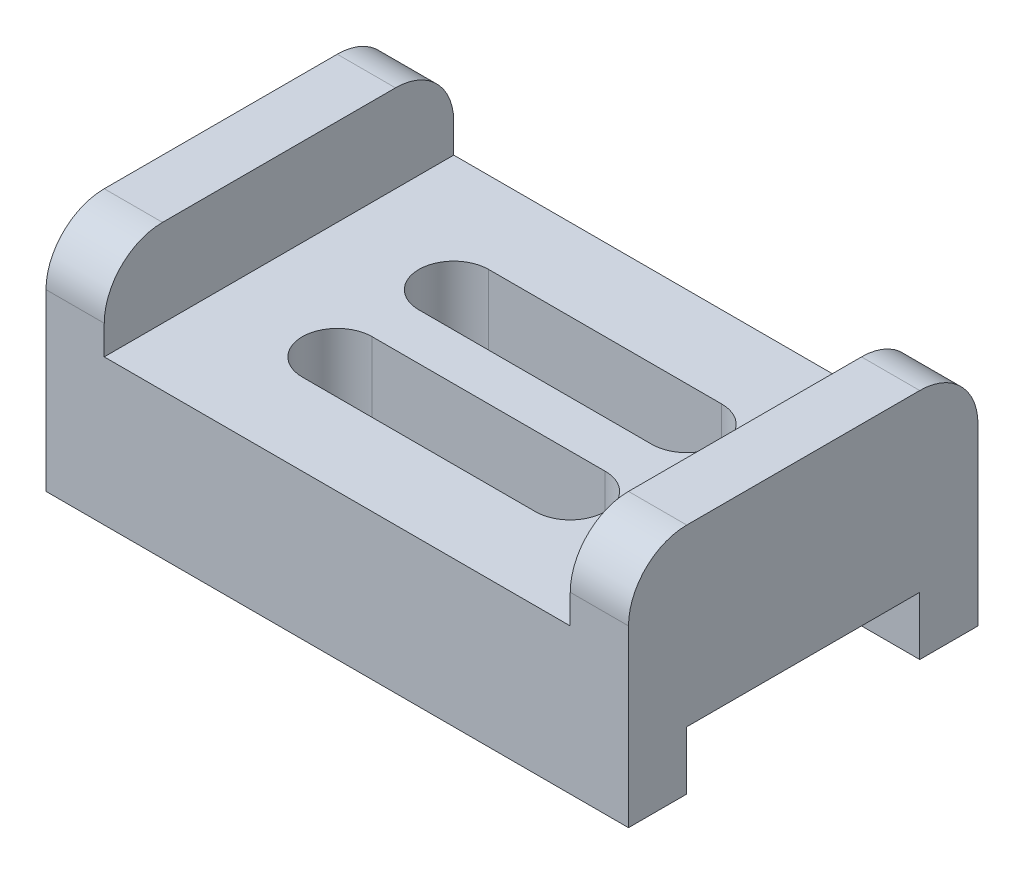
ISO-10303-21;
HEADER;
FILE_DESCRIPTION(('STEP AP214'),'2;1');
FILE_NAME('part.step','',(''),(''),'','','');
FILE_SCHEMA(('AUTOMOTIVE_DESIGN { 1 0 10303 214 1 1 1 1 }'));
ENDSEC;
DATA;
#1=APPLICATION_CONTEXT('core data for automotive mechanical design processes');
#2=APPLICATION_PROTOCOL_DEFINITION('international standard','automotive_design',2000,#1);
#3=PRODUCT_CONTEXT('',#1,'mechanical');
#4=PRODUCT('Part','Part','',(#3));
#5=PRODUCT_RELATED_PRODUCT_CATEGORY('part','',(#4));
#6=PRODUCT_DEFINITION_FORMATION('','',#4);
#7=PRODUCT_DEFINITION_CONTEXT('part definition',#1,'design');
#8=PRODUCT_DEFINITION('design','',#6,#7);
#9=PRODUCT_DEFINITION_SHAPE('','',#8);
#10=(LENGTH_UNIT() NAMED_UNIT(*) SI_UNIT(.MILLI.,.METRE.));
#11=(NAMED_UNIT(*) PLANE_ANGLE_UNIT() SI_UNIT($,.RADIAN.));
#12=(NAMED_UNIT(*) SI_UNIT($,.STERADIAN.) SOLID_ANGLE_UNIT());
#13=UNCERTAINTY_MEASURE_WITH_UNIT(LENGTH_MEASURE(1.E-05),#10,'distance_accuracy_value','');
#14=(GEOMETRIC_REPRESENTATION_CONTEXT(3) GLOBAL_UNCERTAINTY_ASSIGNED_CONTEXT((#13)) GLOBAL_UNIT_ASSIGNED_CONTEXT((#10,
#11,#12)) REPRESENTATION_CONTEXT('',''));
#15=CARTESIAN_POINT('',(0.,0.,0.));
#16=DIRECTION('',(0.,0.,1.));
#17=DIRECTION('',(1.,0.,0.));
#18=AXIS2_PLACEMENT_3D('',#15,#16,#17);
#19=CARTESIAN_POINT('',(0.,40.,0.));
#20=DIRECTION('',(0.,1.,0.));
#21=DIRECTION('',(0.,0.,1.));
#22=AXIS2_PLACEMENT_3D('',#19,#20,#21);
#23=PLANE('',#22);
#24=DIRECTION('',(0.,0.,1.));
#25=VECTOR('',#24,1.);
#26=CARTESIAN_POINT('',(-90.,40.,-60.));
#27=LINE('',#26,#25);
#28=CARTESIAN_POINT('',(-90.,40.,-50.));
#29=VERTEX_POINT('',#28);
#30=CARTESIAN_POINT('',(-90.,40.,-10.));
#31=VERTEX_POINT('',#30);
#32=EDGE_CURVE('E272',#29,#31,#27,.T.);
#33=ORIENTED_EDGE('',*,*,#32,.F.);
#34=DIRECTION('',(-1.,0.,0.));
#35=VECTOR('',#34,1.);
#36=CARTESIAN_POINT('',(-100.,40.,-50.));
#37=LINE('',#36,#35);
#38=CARTESIAN_POINT('',(-100.,40.,-50.));
#39=VERTEX_POINT('',#38);
#40=EDGE_CURVE('E378',#29,#39,#37,.T.);
#41=ORIENTED_EDGE('',*,*,#40,.T.);
#42=DIRECTION('',(0.,0.,1.));
#43=VECTOR('',#42,1.);
#44=CARTESIAN_POINT('',(-100.,40.,0.));
#45=LINE('',#44,#43);
#46=CARTESIAN_POINT('',(-100.,40.,-9.99999999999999));
#47=VERTEX_POINT('',#46);
#48=EDGE_CURVE('E330',#39,#47,#45,.T.);
#49=ORIENTED_EDGE('',*,*,#48,.T.);
#50=DIRECTION('',(1.,0.,0.));
#51=VECTOR('',#50,1.);
#52=CARTESIAN_POINT('',(-90.,40.,-9.99999999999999));
#53=LINE('',#52,#51);
#54=EDGE_CURVE('E375',#47,#31,#53,.T.);
#55=ORIENTED_EDGE('',*,*,#54,.T.);
#56=EDGE_LOOP('',(#33,#41,#49,#55));
#57=FACE_BOUND('',#56,.T.);
#58=ADVANCED_FACE('F33',(#57),#23,.T.);
#59=CARTESIAN_POINT('',(0.,0.,0.));
#60=DIRECTION('',(0.,1.,0.));
#61=DIRECTION('',(0.,0.,1.));
#62=AXIS2_PLACEMENT_3D('',#59,#60,#61);
#63=PLANE('',#62);
#64=DIRECTION('',(0.,0.,1.));
#65=VECTOR('',#64,1.);
#66=CARTESIAN_POINT('',(-100.,0.,0.));
#67=LINE('',#66,#65);
#68=CARTESIAN_POINT('',(-100.,0.,-10.));
#69=VERTEX_POINT('',#68);
#70=CARTESIAN_POINT('',(-100.,0.,0.));
#71=VERTEX_POINT('',#70);
#72=EDGE_CURVE('E340',#69,#71,#67,.T.);
#73=ORIENTED_EDGE('',*,*,#72,.F.);
#74=DIRECTION('',(1.,0.,0.));
#75=VECTOR('',#74,1.);
#76=CARTESIAN_POINT('',(-100.,0.,-10.));
#77=LINE('',#76,#75);
#78=CARTESIAN_POINT('',(0.,0.,-10.));
#79=VERTEX_POINT('',#78);
#80=EDGE_CURVE('E311',#69,#79,#77,.T.);
#81=ORIENTED_EDGE('',*,*,#80,.T.);
#82=DIRECTION('',(0.,0.,-1.));
#83=VECTOR('',#82,1.);
#84=CARTESIAN_POINT('',(0.,0.,0.));
#85=LINE('',#84,#83);
#86=CARTESIAN_POINT('',(0.,0.,0.));
#87=VERTEX_POINT('',#86);
#88=EDGE_CURVE('E334',#87,#79,#85,.T.);
#89=ORIENTED_EDGE('',*,*,#88,.F.);
#90=DIRECTION('',(1.,0.,0.));
#91=VECTOR('',#90,1.);
#92=CARTESIAN_POINT('',(0.,0.,0.));
#93=LINE('',#92,#91);
#94=EDGE_CURVE('E331',#71,#87,#93,.T.);
#95=ORIENTED_EDGE('',*,*,#94,.F.);
#96=EDGE_LOOP('',(#73,#81,#89,#95));
#97=FACE_BOUND('',#96,.T.);
#98=ADVANCED_FACE('F441',(#97),#63,.F.);
#99=CARTESIAN_POINT('',(0.,40.,0.));
#100=DIRECTION('',(-1.,0.,0.));
#101=DIRECTION('',(0.,0.,1.));
#102=AXIS2_PLACEMENT_3D('',#99,#100,#101);
#103=PLANE('',#102);
#104=DIRECTION('',(0.,0.,-1.));
#105=VECTOR('',#104,1.);
#106=CARTESIAN_POINT('',(0.,40.,0.));
#107=LINE('',#106,#105);
#108=CARTESIAN_POINT('',(0.,40.,-10.));
#109=VERTEX_POINT('',#108);
#110=CARTESIAN_POINT('',(0.,40.,-50.));
#111=VERTEX_POINT('',#110);
#112=EDGE_CURVE('E327',#109,#111,#107,.T.);
#113=ORIENTED_EDGE('',*,*,#112,.F.);
#114=CARTESIAN_POINT('',(0.,30.,-10.));
#115=DIRECTION('',(-1.,0.,0.));
#116=DIRECTION('',(0.,0.,1.));
#117=AXIS2_PLACEMENT_3D('',#114,#115,#116);
#118=CIRCLE('',#117,10.);
#119=CARTESIAN_POINT('',(0.,30.,0.));
#120=VERTEX_POINT('',#119);
#121=EDGE_CURVE('E361',#109,#120,#118,.F.);
#122=ORIENTED_EDGE('',*,*,#121,.T.);
#123=DIRECTION('',(0.,-1.,0.));
#124=VECTOR('',#123,1.);
#125=CARTESIAN_POINT('',(0.,40.,0.));
#126=LINE('',#125,#124);
#127=EDGE_CURVE('E333',#120,#87,#126,.T.);
#128=ORIENTED_EDGE('',*,*,#127,.T.);
#129=ORIENTED_EDGE('',*,*,#88,.T.);
#130=DIRECTION('',(0.,-1.,0.));
#131=VECTOR('',#130,1.);
#132=CARTESIAN_POINT('',(0.,10.,-10.));
#133=LINE('',#132,#131);
#134=CARTESIAN_POINT('',(0.,10.,-10.));
#135=VERTEX_POINT('',#134);
#136=EDGE_CURVE('E300',#135,#79,#133,.T.);
#137=ORIENTED_EDGE('',*,*,#136,.F.);
#138=DIRECTION('',(0.,0.,1.));
#139=VECTOR('',#138,1.);
#140=CARTESIAN_POINT('',(0.,10.,-10.));
#141=LINE('',#140,#139);
#142=CARTESIAN_POINT('',(0.,10.,-50.));
#143=VERTEX_POINT('',#142);
#144=EDGE_CURVE('E305',#143,#135,#141,.T.);
#145=ORIENTED_EDGE('',*,*,#144,.F.);
#146=DIRECTION('',(0.,1.,0.));
#147=VECTOR('',#146,1.);
#148=CARTESIAN_POINT('',(0.,10.,-50.));
#149=LINE('',#148,#147);
#150=CARTESIAN_POINT('',(0.,0.,-50.));
#151=VERTEX_POINT('',#150);
#152=EDGE_CURVE('E313',#151,#143,#149,.T.);
#153=ORIENTED_EDGE('',*,*,#152,.F.);
#154=CARTESIAN_POINT('',(0.,0.,-60.));
#155=VERTEX_POINT('',#154);
#156=EDGE_CURVE('E320',#151,#155,#85,.T.);
#157=ORIENTED_EDGE('',*,*,#156,.T.);
#158=DIRECTION('',(0.,-1.,0.));
#159=VECTOR('',#158,1.);
#160=CARTESIAN_POINT('',(0.,40.,-60.));
#161=LINE('',#160,#159);
#162=CARTESIAN_POINT('',(0.,30.,-60.));
#163=VERTEX_POINT('',#162);
#164=EDGE_CURVE('E351',#163,#155,#161,.T.);
#165=ORIENTED_EDGE('',*,*,#164,.F.);
#166=CARTESIAN_POINT('',(0.,30.,-50.));
#167=DIRECTION('',(-1.,0.,0.));
#168=DIRECTION('',(0.,0.,1.));
#169=AXIS2_PLACEMENT_3D('',#166,#167,#168);
#170=CIRCLE('',#169,10.);
#171=EDGE_CURVE('E359',#163,#111,#170,.F.);
#172=ORIENTED_EDGE('',*,*,#171,.T.);
#173=EDGE_LOOP('',(#113,#122,#128,#129,#137,#145,#153,#157,#165,#172));
#174=FACE_BOUND('',#173,.T.);
#175=ADVANCED_FACE('F419',(#174),#103,.F.);
#176=CARTESIAN_POINT('',(0.,40.,-60.));
#177=DIRECTION('',(0.,0.,1.));
#178=DIRECTION('',(1.,0.,0.));
#179=AXIS2_PLACEMENT_3D('',#176,#177,#178);
#180=PLANE('',#179);
#181=DIRECTION('',(0.,1.,0.));
#182=VECTOR('',#181,1.);
#183=CARTESIAN_POINT('',(-9.99999999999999,-100.,-60.));
#184=LINE('',#183,#182);
#185=CARTESIAN_POINT('',(-9.99999999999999,25.,-60.));
#186=VERTEX_POINT('',#185);
#187=CARTESIAN_POINT('',(-9.99999999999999,30.,-60.));
#188=VERTEX_POINT('',#187);
#189=EDGE_CURVE('E290',#186,#188,#184,.T.);
#190=ORIENTED_EDGE('',*,*,#189,.T.);
#191=DIRECTION('',(-1.,0.,0.));
#192=VECTOR('',#191,1.);
#193=CARTESIAN_POINT('',(0.,30.,-60.));
#194=LINE('',#193,#192);
#195=EDGE_CURVE('E373',#188,#163,#194,.F.);
#196=ORIENTED_EDGE('',*,*,#195,.T.);
#197=ORIENTED_EDGE('',*,*,#164,.T.);
#198=DIRECTION('',(-1.,0.,0.));
#199=VECTOR('',#198,1.);
#200=CARTESIAN_POINT('',(0.,0.,-60.));
#201=LINE('',#200,#199);
#202=CARTESIAN_POINT('',(-100.,0.,-60.));
#203=VERTEX_POINT('',#202);
#204=EDGE_CURVE('E337',#155,#203,#201,.T.);
#205=ORIENTED_EDGE('',*,*,#204,.T.);
#206=DIRECTION('',(0.,-1.,0.));
#207=VECTOR('',#206,1.);
#208=CARTESIAN_POINT('',(-100.,40.,-60.));
#209=LINE('',#208,#207);
#210=CARTESIAN_POINT('',(-100.,30.,-60.));
#211=VERTEX_POINT('',#210);
#212=EDGE_CURVE('E349',#211,#203,#209,.T.);
#213=ORIENTED_EDGE('',*,*,#212,.F.);
#214=DIRECTION('',(-1.,0.,0.));
#215=VECTOR('',#214,1.);
#216=CARTESIAN_POINT('',(-90.,30.,-60.));
#217=LINE('',#216,#215);
#218=CARTESIAN_POINT('',(-90.,30.,-60.));
#219=VERTEX_POINT('',#218);
#220=EDGE_CURVE('E371',#211,#219,#217,.F.);
#221=ORIENTED_EDGE('',*,*,#220,.T.);
#222=DIRECTION('',(0.,1.,0.));
#223=VECTOR('',#222,1.);
#224=CARTESIAN_POINT('',(-90.,-100.,-60.));
#225=LINE('',#224,#223);
#226=CARTESIAN_POINT('',(-90.,25.,-60.));
#227=VERTEX_POINT('',#226);
#228=EDGE_CURVE('E276',#227,#219,#225,.T.);
#229=ORIENTED_EDGE('',*,*,#228,.F.);
#230=DIRECTION('',(1.,0.,0.));
#231=VECTOR('',#230,1.);
#232=CARTESIAN_POINT('',(-90.,25.,-60.));
#233=LINE('',#232,#231);
#234=EDGE_CURVE('E275',#227,#186,#233,.T.);
#235=ORIENTED_EDGE('',*,*,#234,.T.);
#236=EDGE_LOOP('',(#190,#196,#197,#205,#213,#221,#229,#235));
#237=FACE_BOUND('',#236,.T.);
#238=ADVANCED_FACE('F397',(#237),#180,.F.);
#239=CARTESIAN_POINT('',(-100.,40.,0.));
#240=DIRECTION('',(1.,0.,0.));
#241=DIRECTION('',(0.,0.,-1.));
#242=AXIS2_PLACEMENT_3D('',#239,#240,#241);
#243=PLANE('',#242);
#244=ORIENTED_EDGE('',*,*,#48,.F.);
#245=CARTESIAN_POINT('',(-100.,30.,-50.));
#246=DIRECTION('',(1.,0.,0.));
#247=DIRECTION('',(0.,0.,-1.));
#248=AXIS2_PLACEMENT_3D('',#245,#246,#247);
#249=CIRCLE('',#248,10.);
#250=EDGE_CURVE('E56',#39,#211,#249,.F.);
#251=ORIENTED_EDGE('',*,*,#250,.T.);
#252=ORIENTED_EDGE('',*,*,#212,.T.);
#253=CARTESIAN_POINT('',(-100.,0.,-50.));
#254=VERTEX_POINT('',#253);
#255=EDGE_CURVE('E341',#203,#254,#67,.T.);
#256=ORIENTED_EDGE('',*,*,#255,.T.);
#257=DIRECTION('',(0.,1.,0.));
#258=VECTOR('',#257,1.);
#259=CARTESIAN_POINT('',(-100.,10.,-50.));
#260=LINE('',#259,#258);
#261=CARTESIAN_POINT('',(-100.,10.,-50.));
#262=VERTEX_POINT('',#261);
#263=EDGE_CURVE('E304',#254,#262,#260,.T.);
#264=ORIENTED_EDGE('',*,*,#263,.T.);
#265=DIRECTION('',(0.,0.,1.));
#266=VECTOR('',#265,1.);
#267=CARTESIAN_POINT('',(-100.,10.,-10.));
#268=LINE('',#267,#266);
#269=CARTESIAN_POINT('',(-100.,10.,-10.));
#270=VERTEX_POINT('',#269);
#271=EDGE_CURVE('E308',#262,#270,#268,.T.);
#272=ORIENTED_EDGE('',*,*,#271,.T.);
#273=DIRECTION('',(0.,-1.,0.));
#274=VECTOR('',#273,1.);
#275=CARTESIAN_POINT('',(-100.,10.,-10.));
#276=LINE('',#275,#274);
#277=EDGE_CURVE('E301',#270,#69,#276,.T.);
#278=ORIENTED_EDGE('',*,*,#277,.T.);
#279=ORIENTED_EDGE('',*,*,#72,.T.);
#280=DIRECTION('',(0.,-1.,0.));
#281=VECTOR('',#280,1.);
#282=CARTESIAN_POINT('',(-100.,40.,0.));
#283=LINE('',#282,#281);
#284=CARTESIAN_POINT('',(-100.,30.,0.));
#285=VERTEX_POINT('',#284);
#286=EDGE_CURVE('E347',#285,#71,#283,.T.);
#287=ORIENTED_EDGE('',*,*,#286,.F.);
#288=CARTESIAN_POINT('',(-100.,30.,-9.99999999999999));
#289=DIRECTION('',(1.,0.,0.));
#290=DIRECTION('',(0.,0.,-1.));
#291=AXIS2_PLACEMENT_3D('',#288,#289,#290);
#292=CIRCLE('',#291,10.);
#293=EDGE_CURVE('E48',#285,#47,#292,.F.);
#294=ORIENTED_EDGE('',*,*,#293,.T.);
#295=EDGE_LOOP('',(#244,#251,#252,#256,#264,#272,#278,#279,#287,#294));
#296=FACE_BOUND('',#295,.T.);
#297=ADVANCED_FACE('F394',(#296),#243,.F.);
#298=CARTESIAN_POINT('',(0.,40.,0.));
#299=DIRECTION('',(0.,0.,-1.));
#300=DIRECTION('',(-1.,0.,0.));
#301=AXIS2_PLACEMENT_3D('',#298,#299,#300);
#302=PLANE('',#301);
#303=ORIENTED_EDGE('',*,*,#127,.F.);
#304=DIRECTION('',(1.,0.,0.));
#305=VECTOR('',#304,1.);
#306=CARTESIAN_POINT('',(-9.99999999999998,30.,0.));
#307=LINE('',#306,#305);
#308=CARTESIAN_POINT('',(-9.99999999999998,30.,0.));
#309=VERTEX_POINT('',#308);
#310=EDGE_CURVE('E365',#120,#309,#307,.F.);
#311=ORIENTED_EDGE('',*,*,#310,.T.);
#312=DIRECTION('',(0.,1.,0.));
#313=VECTOR('',#312,1.);
#314=CARTESIAN_POINT('',(-9.99999999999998,-100.,0.));
#315=LINE('',#314,#313);
#316=CARTESIAN_POINT('',(-9.99999999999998,25.,0.));
#317=VERTEX_POINT('',#316);
#318=EDGE_CURVE('E293',#317,#309,#315,.T.);
#319=ORIENTED_EDGE('',*,*,#318,.F.);
#320=DIRECTION('',(-1.,0.,0.));
#321=VECTOR('',#320,1.);
#322=CARTESIAN_POINT('',(-90.,25.,0.));
#323=LINE('',#322,#321);
#324=CARTESIAN_POINT('',(-90.,25.,0.));
#325=VERTEX_POINT('',#324);
#326=EDGE_CURVE('E281',#317,#325,#323,.T.);
#327=ORIENTED_EDGE('',*,*,#326,.T.);
#328=DIRECTION('',(0.,1.,0.));
#329=VECTOR('',#328,1.);
#330=CARTESIAN_POINT('',(-90.,-100.,0.));
#331=LINE('',#330,#329);
#332=CARTESIAN_POINT('',(-90.,30.,0.));
#333=VERTEX_POINT('',#332);
#334=EDGE_CURVE('E287',#325,#333,#331,.T.);
#335=ORIENTED_EDGE('',*,*,#334,.T.);
#336=DIRECTION('',(1.,0.,0.));
#337=VECTOR('',#336,1.);
#338=CARTESIAN_POINT('',(-100.,30.,0.));
#339=LINE('',#338,#337);
#340=EDGE_CURVE('E363',#333,#285,#339,.F.);
#341=ORIENTED_EDGE('',*,*,#340,.T.);
#342=ORIENTED_EDGE('',*,*,#286,.T.);
#343=ORIENTED_EDGE('',*,*,#94,.T.);
#344=EDGE_LOOP('',(#303,#311,#319,#327,#335,#341,#342,#343));
#345=FACE_BOUND('',#344,.T.);
#346=ADVANCED_FACE('F390',(#345),#302,.F.);
#347=DIRECTION('',(0.,0.,-1.));
#348=VECTOR('',#347,1.);
#349=CARTESIAN_POINT('',(-9.99999999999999,40.,-60.));
#350=LINE('',#349,#348);
#351=CARTESIAN_POINT('',(-9.99999999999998,40.,-9.99999999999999));
#352=VERTEX_POINT('',#351);
#353=CARTESIAN_POINT('',(-9.99999999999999,40.,-50.));
#354=VERTEX_POINT('',#353);
#355=EDGE_CURVE('E284',#352,#354,#350,.T.);
#356=ORIENTED_EDGE('',*,*,#355,.F.);
#357=DIRECTION('',(1.,0.,0.));
#358=VECTOR('',#357,1.);
#359=CARTESIAN_POINT('',(0.,40.,-10.));
#360=LINE('',#359,#358);
#361=EDGE_CURVE('E356',#352,#109,#360,.T.);
#362=ORIENTED_EDGE('',*,*,#361,.T.);
#363=ORIENTED_EDGE('',*,*,#112,.T.);
#364=DIRECTION('',(-1.,0.,0.));
#365=VECTOR('',#364,1.);
#366=CARTESIAN_POINT('',(-9.99999999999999,40.,-50.));
#367=LINE('',#366,#365);
#368=EDGE_CURVE('E353',#111,#354,#367,.T.);
#369=ORIENTED_EDGE('',*,*,#368,.T.);
#370=EDGE_LOOP('',(#356,#362,#363,#369));
#371=FACE_BOUND('',#370,.T.);
#372=ADVANCED_FACE('F415',(#371),#23,.T.);
#373=ORIENTED_EDGE('',*,*,#156,.F.);
#374=DIRECTION('',(1.,0.,0.));
#375=VECTOR('',#374,1.);
#376=CARTESIAN_POINT('',(-100.,0.,-50.));
#377=LINE('',#376,#375);
#378=EDGE_CURVE('E323',#254,#151,#377,.T.);
#379=ORIENTED_EDGE('',*,*,#378,.F.);
#380=ORIENTED_EDGE('',*,*,#255,.F.);
#381=ORIENTED_EDGE('',*,*,#204,.F.);
#382=EDGE_LOOP('',(#373,#379,#380,#381));
#383=FACE_BOUND('',#382,.T.);
#384=ADVANCED_FACE('F427',(#383),#63,.F.);
#385=CARTESIAN_POINT('',(-100.,10.,-10.));
#386=DIRECTION('',(0.,0.,1.));
#387=DIRECTION('',(0.,-1.,0.));
#388=AXIS2_PLACEMENT_3D('',#385,#386,#387);
#389=PLANE('',#388);
#390=ORIENTED_EDGE('',*,*,#136,.T.);
#391=ORIENTED_EDGE('',*,*,#80,.F.);
#392=ORIENTED_EDGE('',*,*,#277,.F.);
#393=DIRECTION('',(1.,0.,0.));
#394=VECTOR('',#393,1.);
#395=CARTESIAN_POINT('',(-100.,10.,-10.));
#396=LINE('',#395,#394);
#397=EDGE_CURVE('E318',#270,#135,#396,.T.);
#398=ORIENTED_EDGE('',*,*,#397,.T.);
#399=EDGE_LOOP('',(#390,#391,#392,#398));
#400=FACE_BOUND('',#399,.T.);
#401=ADVANCED_FACE('F436',(#400),#389,.F.);
#402=CARTESIAN_POINT('',(-100.,10.,-10.));
#403=DIRECTION('',(0.,1.,0.));
#404=DIRECTION('',(0.,0.,1.));
#405=AXIS2_PLACEMENT_3D('',#402,#403,#404);
#406=PLANE('',#405);
#407=DIRECTION('',(-1.,0.,0.));
#408=VECTOR('',#407,1.);
#409=CARTESIAN_POINT('',(-100.,10.,-26.));
#410=LINE('',#409,#408);
#411=CARTESIAN_POINT('',(-30.,10.,-26.));
#412=VERTEX_POINT('',#411);
#413=CARTESIAN_POINT('',(-70.,10.,-26.));
#414=VERTEX_POINT('',#413);
#415=EDGE_CURVE('E234',#412,#414,#410,.T.);
#416=ORIENTED_EDGE('',*,*,#415,.T.);
#417=CARTESIAN_POINT('',(-70.,10.,-20.));
#418=DIRECTION('',(0.,1.,0.));
#419=DIRECTION('',(0.,0.,1.));
#420=AXIS2_PLACEMENT_3D('',#417,#418,#419);
#421=CIRCLE('',#420,6.);
#422=CARTESIAN_POINT('',(-70.,10.,-14.));
#423=VERTEX_POINT('',#422);
#424=EDGE_CURVE('E237',#414,#423,#421,.T.);
#425=ORIENTED_EDGE('',*,*,#424,.T.);
#426=DIRECTION('',(1.,0.,0.));
#427=VECTOR('',#426,1.);
#428=CARTESIAN_POINT('',(-100.,10.,-14.));
#429=LINE('',#428,#427);
#430=CARTESIAN_POINT('',(-30.,10.,-14.));
#431=VERTEX_POINT('',#430);
#432=EDGE_CURVE('E229',#423,#431,#429,.T.);
#433=ORIENTED_EDGE('',*,*,#432,.T.);
#434=CARTESIAN_POINT('',(-30.,10.,-20.));
#435=DIRECTION('',(0.,1.,0.));
#436=DIRECTION('',(0.,0.,1.));
#437=AXIS2_PLACEMENT_3D('',#434,#435,#436);
#438=CIRCLE('',#437,6.);
#439=EDGE_CURVE('E204',#431,#412,#438,.T.);
#440=ORIENTED_EDGE('',*,*,#439,.T.);
#441=EDGE_LOOP('',(#416,#425,#433,#440));
#442=FACE_BOUND('',#441,.T.);
#443=DIRECTION('',(-1.,0.,0.));
#444=VECTOR('',#443,1.);
#445=CARTESIAN_POINT('',(-100.,10.,-46.));
#446=LINE('',#445,#444);
#447=CARTESIAN_POINT('',(-30.,10.,-46.));
#448=VERTEX_POINT('',#447);
#449=CARTESIAN_POINT('',(-70.,10.,-46.));
#450=VERTEX_POINT('',#449);
#451=EDGE_CURVE('E266',#448,#450,#446,.T.);
#452=ORIENTED_EDGE('',*,*,#451,.T.);
#453=CARTESIAN_POINT('',(-70.,10.,-40.));
#454=DIRECTION('',(0.,1.,0.));
#455=DIRECTION('',(0.,0.,1.));
#456=AXIS2_PLACEMENT_3D('',#453,#454,#455);
#457=CIRCLE('',#456,6.);
#458=CARTESIAN_POINT('',(-70.,10.,-34.));
#459=VERTEX_POINT('',#458);
#460=EDGE_CURVE('E269',#450,#459,#457,.T.);
#461=ORIENTED_EDGE('',*,*,#460,.T.);
#462=DIRECTION('',(1.,0.,0.));
#463=VECTOR('',#462,1.);
#464=CARTESIAN_POINT('',(-100.,10.,-34.));
#465=LINE('',#464,#463);
#466=CARTESIAN_POINT('',(-30.,10.,-34.));
#467=VERTEX_POINT('',#466);
#468=EDGE_CURVE('E254',#459,#467,#465,.T.);
#469=ORIENTED_EDGE('',*,*,#468,.T.);
#470=CARTESIAN_POINT('',(-30.,10.,-40.));
#471=DIRECTION('',(0.,1.,0.));
#472=DIRECTION('',(0.,0.,1.));
#473=AXIS2_PLACEMENT_3D('',#470,#471,#472);
#474=CIRCLE('',#473,6.);
#475=EDGE_CURVE('E263',#467,#448,#474,.T.);
#476=ORIENTED_EDGE('',*,*,#475,.T.);
#477=EDGE_LOOP('',(#452,#461,#469,#476));
#478=FACE_BOUND('',#477,.T.);
#479=ORIENTED_EDGE('',*,*,#144,.T.);
#480=ORIENTED_EDGE('',*,*,#397,.F.);
#481=ORIENTED_EDGE('',*,*,#271,.F.);
#482=DIRECTION('',(1.,0.,0.));
#483=VECTOR('',#482,1.);
#484=CARTESIAN_POINT('',(-100.,10.,-50.));
#485=LINE('',#484,#483);
#486=EDGE_CURVE('E321',#262,#143,#485,.T.);
#487=ORIENTED_EDGE('',*,*,#486,.T.);
#488=EDGE_LOOP('',(#479,#480,#481,#487));
#489=FACE_BOUND('',#488,.T.);
#490=ADVANCED_FACE('F432',(#442,#478,#489),#406,.F.);
#491=CARTESIAN_POINT('',(-100.,10.,-50.));
#492=DIRECTION('',(0.,0.,-1.));
#493=DIRECTION('',(-1.,0.,0.));
#494=AXIS2_PLACEMENT_3D('',#491,#492,#493);
#495=PLANE('',#494);
#496=ORIENTED_EDGE('',*,*,#152,.T.);
#497=ORIENTED_EDGE('',*,*,#486,.F.);
#498=ORIENTED_EDGE('',*,*,#263,.F.);
#499=ORIENTED_EDGE('',*,*,#378,.T.);
#500=EDGE_LOOP('',(#496,#497,#498,#499));
#501=FACE_BOUND('',#500,.T.);
#502=ADVANCED_FACE('F430',(#501),#495,.F.);
#503=CARTESIAN_POINT('',(-90.,-100.,-60.));
#504=DIRECTION('',(-1.,0.,0.));
#505=DIRECTION('',(0.,0.,1.));
#506=AXIS2_PLACEMENT_3D('',#503,#504,#505);
#507=PLANE('',#506);
#508=ORIENTED_EDGE('',*,*,#228,.T.);
#509=CARTESIAN_POINT('',(-90.,30.,-50.));
#510=DIRECTION('',(-1.,0.,0.));
#511=DIRECTION('',(0.,0.,1.));
#512=AXIS2_PLACEMENT_3D('',#509,#510,#511);
#513=CIRCLE('',#512,10.);
#514=EDGE_CURVE('E12',#219,#29,#513,.F.);
#515=ORIENTED_EDGE('',*,*,#514,.T.);
#516=ORIENTED_EDGE('',*,*,#32,.T.);
#517=CARTESIAN_POINT('',(-90.,30.,-9.99999999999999));
#518=DIRECTION('',(-1.,0.,0.));
#519=DIRECTION('',(0.,0.,1.));
#520=AXIS2_PLACEMENT_3D('',#517,#518,#519);
#521=CIRCLE('',#520,10.);
#522=EDGE_CURVE('E41',#31,#333,#521,.F.);
#523=ORIENTED_EDGE('',*,*,#522,.T.);
#524=ORIENTED_EDGE('',*,*,#334,.F.);
#525=DIRECTION('',(0.,0.,-1.));
#526=VECTOR('',#525,1.);
#527=CARTESIAN_POINT('',(-90.,25.,-60.));
#528=LINE('',#527,#526);
#529=EDGE_CURVE('E279',#325,#227,#528,.T.);
#530=ORIENTED_EDGE('',*,*,#529,.T.);
#531=EDGE_LOOP('',(#508,#515,#516,#523,#524,#530));
#532=FACE_BOUND('',#531,.T.);
#533=ADVANCED_FACE('F383',(#532),#507,.F.);
#534=CARTESIAN_POINT('',(-9.99999999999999,-100.,-60.));
#535=DIRECTION('',(1.,0.,0.));
#536=DIRECTION('',(0.,0.,-1.));
#537=AXIS2_PLACEMENT_3D('',#534,#535,#536);
#538=PLANE('',#537);
#539=ORIENTED_EDGE('',*,*,#318,.T.);
#540=CARTESIAN_POINT('',(-9.99999999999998,30.,-10.));
#541=DIRECTION('',(1.,0.,0.));
#542=DIRECTION('',(0.,0.,-1.));
#543=AXIS2_PLACEMENT_3D('',#540,#541,#542);
#544=CIRCLE('',#543,10.);
#545=EDGE_CURVE('E369',#309,#352,#544,.F.);
#546=ORIENTED_EDGE('',*,*,#545,.T.);
#547=ORIENTED_EDGE('',*,*,#355,.T.);
#548=CARTESIAN_POINT('',(-9.99999999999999,30.,-50.));
#549=DIRECTION('',(1.,0.,0.));
#550=DIRECTION('',(0.,0.,-1.));
#551=AXIS2_PLACEMENT_3D('',#548,#549,#550);
#552=CIRCLE('',#551,10.);
#553=EDGE_CURVE('E367',#354,#188,#552,.F.);
#554=ORIENTED_EDGE('',*,*,#553,.T.);
#555=ORIENTED_EDGE('',*,*,#189,.F.);
#556=DIRECTION('',(0.,0.,1.));
#557=VECTOR('',#556,1.);
#558=CARTESIAN_POINT('',(-9.99999999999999,25.,-60.));
#559=LINE('',#558,#557);
#560=EDGE_CURVE('E273',#186,#317,#559,.T.);
#561=ORIENTED_EDGE('',*,*,#560,.T.);
#562=EDGE_LOOP('',(#539,#546,#547,#554,#555,#561));
#563=FACE_BOUND('',#562,.T.);
#564=ADVANCED_FACE('F408',(#563),#538,.F.);
#565=CARTESIAN_POINT('',(0.,25.,0.));
#566=DIRECTION('',(0.,1.,0.));
#567=DIRECTION('',(0.,0.,1.));
#568=AXIS2_PLACEMENT_3D('',#565,#566,#567);
#569=PLANE('',#568);
#570=CARTESIAN_POINT('',(-70.,25.,-20.));
#571=DIRECTION('',(0.,1.,0.));
#572=DIRECTION('',(0.,0.,1.));
#573=AXIS2_PLACEMENT_3D('',#570,#571,#572);
#574=CIRCLE('',#573,6.);
#575=CARTESIAN_POINT('',(-70.,25.,-26.));
#576=VERTEX_POINT('',#575);
#577=CARTESIAN_POINT('',(-70.,25.,-14.));
#578=VERTEX_POINT('',#577);
#579=EDGE_CURVE('E217',#576,#578,#574,.T.);
#580=ORIENTED_EDGE('',*,*,#579,.F.);
#581=DIRECTION('',(-1.,0.,0.));
#582=VECTOR('',#581,1.);
#583=CARTESIAN_POINT('',(-70.,25.,-26.));
#584=LINE('',#583,#582);
#585=CARTESIAN_POINT('',(-30.,25.,-26.));
#586=VERTEX_POINT('',#585);
#587=EDGE_CURVE('E222',#586,#576,#584,.T.);
#588=ORIENTED_EDGE('',*,*,#587,.F.);
#589=CARTESIAN_POINT('',(-30.,25.,-20.));
#590=DIRECTION('',(0.,1.,0.));
#591=DIRECTION('',(0.,0.,1.));
#592=AXIS2_PLACEMENT_3D('',#589,#590,#591);
#593=CIRCLE('',#592,6.);
#594=CARTESIAN_POINT('',(-30.,25.,-14.));
#595=VERTEX_POINT('',#594);
#596=EDGE_CURVE('E201',#595,#586,#593,.T.);
#597=ORIENTED_EDGE('',*,*,#596,.F.);
#598=DIRECTION('',(1.,0.,0.));
#599=VECTOR('',#598,1.);
#600=CARTESIAN_POINT('',(-70.,25.,-14.));
#601=LINE('',#600,#599);
#602=EDGE_CURVE('E212',#578,#595,#601,.T.);
#603=ORIENTED_EDGE('',*,*,#602,.F.);
#604=EDGE_LOOP('',(#580,#588,#597,#603));
#605=FACE_BOUND('',#604,.T.);
#606=CARTESIAN_POINT('',(-70.,25.,-40.));
#607=DIRECTION('',(0.,1.,0.));
#608=DIRECTION('',(0.,0.,1.));
#609=AXIS2_PLACEMENT_3D('',#606,#607,#608);
#610=CIRCLE('',#609,6.);
#611=CARTESIAN_POINT('',(-70.,25.,-46.));
#612=VERTEX_POINT('',#611);
#613=CARTESIAN_POINT('',(-70.,25.,-34.));
#614=VERTEX_POINT('',#613);
#615=EDGE_CURVE('E240',#612,#614,#610,.T.);
#616=ORIENTED_EDGE('',*,*,#615,.F.);
#617=DIRECTION('',(-1.,0.,0.));
#618=VECTOR('',#617,1.);
#619=CARTESIAN_POINT('',(-70.,25.,-46.));
#620=LINE('',#619,#618);
#621=CARTESIAN_POINT('',(-30.,25.,-46.));
#622=VERTEX_POINT('',#621);
#623=EDGE_CURVE('E248',#622,#612,#620,.T.);
#624=ORIENTED_EDGE('',*,*,#623,.F.);
#625=CARTESIAN_POINT('',(-30.,25.,-40.));
#626=DIRECTION('',(0.,1.,0.));
#627=DIRECTION('',(0.,0.,1.));
#628=AXIS2_PLACEMENT_3D('',#625,#626,#627);
#629=CIRCLE('',#628,6.);
#630=CARTESIAN_POINT('',(-30.,25.,-34.));
#631=VERTEX_POINT('',#630);
#632=EDGE_CURVE('E245',#631,#622,#629,.T.);
#633=ORIENTED_EDGE('',*,*,#632,.F.);
#634=DIRECTION('',(1.,0.,0.));
#635=VECTOR('',#634,1.);
#636=CARTESIAN_POINT('',(-70.,25.,-34.));
#637=LINE('',#636,#635);
#638=EDGE_CURVE('E242',#614,#631,#637,.T.);
#639=ORIENTED_EDGE('',*,*,#638,.F.);
#640=EDGE_LOOP('',(#616,#624,#633,#639));
#641=FACE_BOUND('',#640,.T.);
#642=ORIENTED_EDGE('',*,*,#529,.F.);
#643=ORIENTED_EDGE('',*,*,#326,.F.);
#644=ORIENTED_EDGE('',*,*,#560,.F.);
#645=ORIENTED_EDGE('',*,*,#234,.F.);
#646=EDGE_LOOP('',(#642,#643,#644,#645));
#647=FACE_BOUND('',#646,.T.);
#648=ADVANCED_FACE('F219',(#605,#641,#647),#569,.T.);
#649=CARTESIAN_POINT('',(-70.,0.,-40.));
#650=DIRECTION('',(0.,1.,0.));
#651=DIRECTION('',(0.,0.,1.));
#652=AXIS2_PLACEMENT_3D('',#649,#650,#651);
#653=CYLINDRICAL_SURFACE('',#652,6.);
#654=DIRECTION('',(0.,1.,0.));
#655=VECTOR('',#654,1.);
#656=CARTESIAN_POINT('',(-70.,0.,-46.));
#657=LINE('',#656,#655);
#658=EDGE_CURVE('E252',#450,#612,#657,.T.);
#659=ORIENTED_EDGE('',*,*,#658,.T.);
#660=ORIENTED_EDGE('',*,*,#615,.T.);
#661=DIRECTION('',(0.,1.,0.));
#662=VECTOR('',#661,1.);
#663=CARTESIAN_POINT('',(-70.,0.,-34.));
#664=LINE('',#663,#662);
#665=EDGE_CURVE('E251',#459,#614,#664,.T.);
#666=ORIENTED_EDGE('',*,*,#665,.F.);
#667=ORIENTED_EDGE('',*,*,#460,.F.);
#668=EDGE_LOOP('',(#659,#660,#666,#667));
#669=FACE_BOUND('',#668,.T.);
#670=ADVANCED_FACE('F600',(#669),#653,.F.);
#671=CARTESIAN_POINT('',(-70.,0.,-46.));
#672=DIRECTION('',(0.,0.,-1.));
#673=DIRECTION('',(-1.,0.,0.));
#674=AXIS2_PLACEMENT_3D('',#671,#672,#673);
#675=PLANE('',#674);
#676=DIRECTION('',(0.,1.,0.));
#677=VECTOR('',#676,1.);
#678=CARTESIAN_POINT('',(-30.,0.,-46.));
#679=LINE('',#678,#677);
#680=EDGE_CURVE('E255',#448,#622,#679,.T.);
#681=ORIENTED_EDGE('',*,*,#680,.T.);
#682=ORIENTED_EDGE('',*,*,#623,.T.);
#683=ORIENTED_EDGE('',*,*,#658,.F.);
#684=ORIENTED_EDGE('',*,*,#451,.F.);
#685=EDGE_LOOP('',(#681,#682,#683,#684));
#686=FACE_BOUND('',#685,.T.);
#687=ADVANCED_FACE('F591',(#686),#675,.F.);
#688=CARTESIAN_POINT('',(-30.,0.,-40.));
#689=DIRECTION('',(0.,1.,0.));
#690=DIRECTION('',(0.,0.,1.));
#691=AXIS2_PLACEMENT_3D('',#688,#689,#690);
#692=CYLINDRICAL_SURFACE('',#691,6.);
#693=DIRECTION('',(0.,1.,0.));
#694=VECTOR('',#693,1.);
#695=CARTESIAN_POINT('',(-30.,0.,-34.));
#696=LINE('',#695,#694);
#697=EDGE_CURVE('E257',#467,#631,#696,.T.);
#698=ORIENTED_EDGE('',*,*,#697,.T.);
#699=ORIENTED_EDGE('',*,*,#632,.T.);
#700=ORIENTED_EDGE('',*,*,#680,.F.);
#701=ORIENTED_EDGE('',*,*,#475,.F.);
#702=EDGE_LOOP('',(#698,#699,#700,#701));
#703=FACE_BOUND('',#702,.T.);
#704=ADVANCED_FACE('F582',(#703),#692,.F.);
#705=CARTESIAN_POINT('',(-70.,0.,-34.));
#706=DIRECTION('',(0.,0.,1.));
#707=DIRECTION('',(1.,0.,0.));
#708=AXIS2_PLACEMENT_3D('',#705,#706,#707);
#709=PLANE('',#708);
#710=ORIENTED_EDGE('',*,*,#665,.T.);
#711=ORIENTED_EDGE('',*,*,#638,.T.);
#712=ORIENTED_EDGE('',*,*,#697,.F.);
#713=ORIENTED_EDGE('',*,*,#468,.F.);
#714=EDGE_LOOP('',(#710,#711,#712,#713));
#715=FACE_BOUND('',#714,.T.);
#716=ADVANCED_FACE('F573',(#715),#709,.F.);
#717=CARTESIAN_POINT('',(-70.,0.,-20.));
#718=DIRECTION('',(0.,1.,0.));
#719=DIRECTION('',(0.,0.,1.));
#720=AXIS2_PLACEMENT_3D('',#717,#718,#719);
#721=CYLINDRICAL_SURFACE('',#720,6.);
#722=DIRECTION('',(0.,1.,0.));
#723=VECTOR('',#722,1.);
#724=CARTESIAN_POINT('',(-70.,0.,-26.));
#725=LINE('',#724,#723);
#726=EDGE_CURVE('E227',#414,#576,#725,.T.);
#727=ORIENTED_EDGE('',*,*,#726,.T.);
#728=ORIENTED_EDGE('',*,*,#579,.T.);
#729=DIRECTION('',(0.,1.,0.));
#730=VECTOR('',#729,1.);
#731=CARTESIAN_POINT('',(-70.,0.,-14.));
#732=LINE('',#731,#730);
#733=EDGE_CURVE('E208',#423,#578,#732,.T.);
#734=ORIENTED_EDGE('',*,*,#733,.F.);
#735=ORIENTED_EDGE('',*,*,#424,.F.);
#736=EDGE_LOOP('',(#727,#728,#734,#735));
#737=FACE_BOUND('',#736,.T.);
#738=ADVANCED_FACE('F564',(#737),#721,.F.);
#739=CARTESIAN_POINT('',(-70.,0.,-26.));
#740=DIRECTION('',(0.,0.,-1.));
#741=DIRECTION('',(-1.,0.,0.));
#742=AXIS2_PLACEMENT_3D('',#739,#740,#741);
#743=PLANE('',#742);
#744=DIRECTION('',(0.,1.,0.));
#745=VECTOR('',#744,1.);
#746=CARTESIAN_POINT('',(-30.,0.,-26.));
#747=LINE('',#746,#745);
#748=EDGE_CURVE('E207',#412,#586,#747,.T.);
#749=ORIENTED_EDGE('',*,*,#748,.T.);
#750=ORIENTED_EDGE('',*,*,#587,.T.);
#751=ORIENTED_EDGE('',*,*,#726,.F.);
#752=ORIENTED_EDGE('',*,*,#415,.F.);
#753=EDGE_LOOP('',(#749,#750,#751,#752));
#754=FACE_BOUND('',#753,.T.);
#755=ADVANCED_FACE('F556',(#754),#743,.F.);
#756=CARTESIAN_POINT('',(-30.,0.,-20.));
#757=DIRECTION('',(0.,1.,0.));
#758=DIRECTION('',(0.,0.,1.));
#759=AXIS2_PLACEMENT_3D('',#756,#757,#758);
#760=CYLINDRICAL_SURFACE('',#759,6.);
#761=DIRECTION('',(0.,1.,0.));
#762=VECTOR('',#761,1.);
#763=CARTESIAN_POINT('',(-30.,0.,-14.));
#764=LINE('',#763,#762);
#765=EDGE_CURVE('E196',#431,#595,#764,.T.);
#766=ORIENTED_EDGE('',*,*,#765,.T.);
#767=ORIENTED_EDGE('',*,*,#596,.T.);
#768=ORIENTED_EDGE('',*,*,#748,.F.);
#769=ORIENTED_EDGE('',*,*,#439,.F.);
#770=EDGE_LOOP('',(#766,#767,#768,#769));
#771=FACE_BOUND('',#770,.T.);
#772=ADVANCED_FACE('F198',(#771),#760,.F.);
#773=CARTESIAN_POINT('',(-70.,0.,-14.));
#774=DIRECTION('',(0.,0.,1.));
#775=DIRECTION('',(1.,0.,0.));
#776=AXIS2_PLACEMENT_3D('',#773,#774,#775);
#777=PLANE('',#776);
#778=ORIENTED_EDGE('',*,*,#733,.T.);
#779=ORIENTED_EDGE('',*,*,#602,.T.);
#780=ORIENTED_EDGE('',*,*,#765,.F.);
#781=ORIENTED_EDGE('',*,*,#432,.F.);
#782=EDGE_LOOP('',(#778,#779,#780,#781));
#783=FACE_BOUND('',#782,.T.);
#784=ADVANCED_FACE('F213',(#783),#777,.F.);
#785=CARTESIAN_POINT('',(0.,30.,-10.));
#786=DIRECTION('',(-1.,0.,0.));
#787=DIRECTION('',(0.,0.,1.));
#788=AXIS2_PLACEMENT_3D('',#785,#786,#787);
#789=CYLINDRICAL_SURFACE('',#788,10.);
#790=ORIENTED_EDGE('',*,*,#545,.F.);
#791=ORIENTED_EDGE('',*,*,#310,.F.);
#792=ORIENTED_EDGE('',*,*,#121,.F.);
#793=ORIENTED_EDGE('',*,*,#361,.F.);
#794=EDGE_LOOP('',(#790,#791,#792,#793));
#795=FACE_BOUND('',#794,.T.);
#796=ADVANCED_FACE('F446',(#795),#789,.T.);
#797=CARTESIAN_POINT('',(0.,30.,-50.));
#798=DIRECTION('',(1.,0.,0.));
#799=DIRECTION('',(0.,0.,-1.));
#800=AXIS2_PLACEMENT_3D('',#797,#798,#799);
#801=CYLINDRICAL_SURFACE('',#800,10.);
#802=ORIENTED_EDGE('',*,*,#171,.F.);
#803=ORIENTED_EDGE('',*,*,#195,.F.);
#804=ORIENTED_EDGE('',*,*,#553,.F.);
#805=ORIENTED_EDGE('',*,*,#368,.F.);
#806=EDGE_LOOP('',(#802,#803,#804,#805));
#807=FACE_BOUND('',#806,.T.);
#808=ADVANCED_FACE('F413',(#807),#801,.T.);
#809=CARTESIAN_POINT('',(0.,30.,-50.));
#810=DIRECTION('',(1.,0.,0.));
#811=DIRECTION('',(0.,0.,-1.));
#812=AXIS2_PLACEMENT_3D('',#809,#810,#811);
#813=CYLINDRICAL_SURFACE('',#812,10.);
#814=ORIENTED_EDGE('',*,*,#514,.F.);
#815=ORIENTED_EDGE('',*,*,#220,.F.);
#816=ORIENTED_EDGE('',*,*,#250,.F.);
#817=ORIENTED_EDGE('',*,*,#40,.F.);
#818=EDGE_LOOP('',(#814,#815,#816,#817));
#819=FACE_BOUND('',#818,.T.);
#820=ADVANCED_FACE('F402',(#819),#813,.T.);
#821=CARTESIAN_POINT('',(0.,30.,-10.));
#822=DIRECTION('',(-1.,0.,0.));
#823=DIRECTION('',(0.,0.,1.));
#824=AXIS2_PLACEMENT_3D('',#821,#822,#823);
#825=CYLINDRICAL_SURFACE('',#824,10.);
#826=ORIENTED_EDGE('',*,*,#293,.F.);
#827=ORIENTED_EDGE('',*,*,#340,.F.);
#828=ORIENTED_EDGE('',*,*,#522,.F.);
#829=ORIENTED_EDGE('',*,*,#54,.F.);
#830=EDGE_LOOP('',(#826,#827,#828,#829));
#831=FACE_BOUND('',#830,.T.);
#832=ADVANCED_FACE('F35',(#831),#825,.T.);
#833=CLOSED_SHELL('',(#58,#98,#175,#238,#297,#346,#372,#384,#401,#490,#502,#533,#564,#648,#670,
#687,#704,#716,#738,#755,#772,#784,#796,#808,#820,#832));
#834=MANIFOLD_SOLID_BREP('B2',#833);
#835=ADVANCED_BREP_SHAPE_REPRESENTATION('',(#18,#834),#14);
#836=SHAPE_DEFINITION_REPRESENTATION(#9,#835);
ENDSEC;
END-ISO-10303-21;
